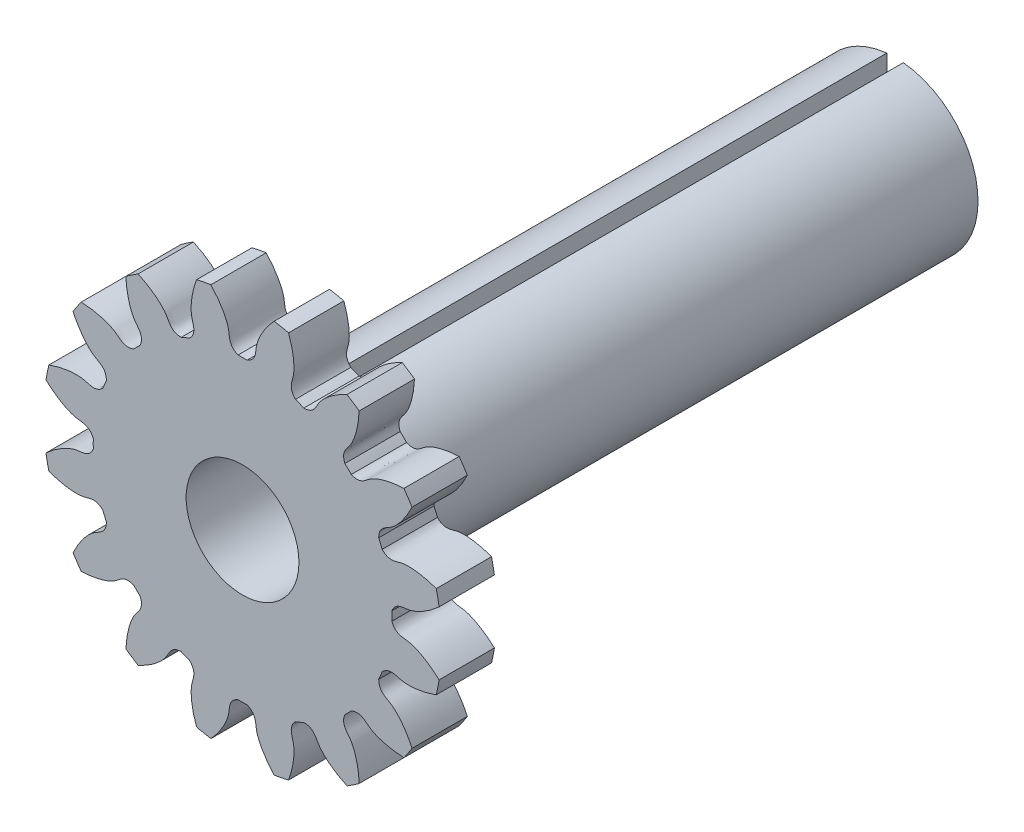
from build123d import *

# Parameters (mm, degrees)
SKETCH_1_R               = 18
EXTRUDE_1_DEPTH          = 30
CUT_EXTRUDE_1_DEPTH      = 40.344631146
PATTERN_CIRCULAR_1_COUNT = 16
SKETCH_4_R               = 23.482997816
CUT_EXTRUDE_2_DEPTH      = 20
SKETCH_5_R               = 9
EXTRUDE_2_DEPTH          = 2
SKETCH_6_R               = 7.5
EXTRUDE_3_DEPTH          = 54
SKETCH_7_R               = 5.1
CUT_EXTRUDE_3_DEPTH      = 63
CUT_EXTRUDE_START        = -4
SKETCH_8_R               = 7.5
CUT_EXTRUDE_4_DEPTH      = 4
CUT_EXTRUDE_START_2      = -50
CUT_EXTRUDE_5_DEPTH      = 50
EXTRUDE_4_DEPTH          = 2
SKETCH_11_R              = 22.388726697
CUT_EXTRUDE_6_DEPTH      = 5


with BuildPart() as part:
    # Sketch 1 → Extrude 1 (new body)
    with BuildSketch(Plane.XY):
        Circle(SKETCH_1_R)
    extrude(amount=EXTRUDE_1_DEPTH)

    # Sketch 2 → Cut-Extrude 1 (cut, through all)
    with BuildSketch(Plane.XY):
        with BuildLine():
            ThreePointArc((0.40672158, 13.493871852), (0, 13.5), (-0.40672158, 13.493871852))
            add(Edge.make_bspline(
                [(-0.40672158, 13.493871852), (-1.283678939, 13.860244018), (-1.138642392, 14.541399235), (-1.289562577, 15.17361985), (-1.302405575, 15.223101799), (-1.317864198, 15.278107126), (-1.336157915, 15.338549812), (-1.357511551, 15.404335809), (-1.382144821, 15.475364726), (-1.410275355, 15.551529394), (-1.442117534, 15.632716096), (-1.477882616, 15.718804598), (-1.517778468, 15.809668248), (-1.562009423, 15.905174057), (-1.610776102, 16.005182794), (-1.664275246, 16.109549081), (-1.722699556, 16.218121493), (-1.786237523, 16.330742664), (-1.855073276, 16.447249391), (-1.929386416, 16.567472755), (-2.009351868, 16.691238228), (-2.095139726, 16.8183658), (-2.186915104, 16.948670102), (-2.284837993, 17.081960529), (-2.389063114, 17.21804138), (-2.499739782, 17.356711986), (-2.617011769, 17.497766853), (-2.74101717, 17.640995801), (-2.871888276, 17.786184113), (-3.009751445, 17.933112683), (-3.154726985, 18.081558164), (-3.306929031, 18.23129313), (-3.466465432, 18.382086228), (-3.633437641, 18.533702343), (-3.807940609, 18.68590276), (-3.990062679, 18.838445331), (-4.179885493, 18.991084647), (-4.377483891, 19.143572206), (-4.582925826, 19.295656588), (-4.796272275, 19.447083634), (-5.017577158, 19.597596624), (-5.246887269, 19.746936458), (-5.484242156, 19.89484184), (-5.814929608, 20.091837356), (-6.069976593, 20.233482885), (-6.243559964, 20.3254849)],
                knots=[0, 0, 0, 0, 0.200958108, 0.205848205, 0.211390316, 0.217584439, 0.224430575, 0.231928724, 0.240078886, 0.248881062, 0.25833525, 0.268441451, 0.279199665, 0.290609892, 0.302672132, 0.315386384, 0.32875265, 0.342770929, 0.357441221, 0.372763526, 0.388737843, 0.405364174, 0.422642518, 0.440572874, 0.459155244, 0.478389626, 0.498276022, 0.51881443, 0.540004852, 0.561847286, 0.584341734, 0.607488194, 0.631286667, 0.655737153, 0.680839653, 0.706594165, 0.73300069, 0.760059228, 0.787769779, 0.816132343, 0.84514692, 0.87481351, 0.905132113, 0.936102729, 1, 1, 1, 1], degree=3))
            ThreePointArc((-6.243559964, 20.3254849), (0, 21.26281678), (6.243559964, 20.3254849))
            add(Edge.make_bspline(
                [(0.40672158, 13.493871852), (1.283678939, 13.860244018), (1.138642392, 14.541399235), (1.289562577, 15.17361985), (1.302405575, 15.223101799), (1.317864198, 15.278107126), (1.336157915, 15.338549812), (1.357511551, 15.404335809), (1.382144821, 15.475364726), (1.410275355, 15.551529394), (1.442117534, 15.632716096), (1.477882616, 15.718804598), (1.517778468, 15.809668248), (1.562009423, 15.905174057), (1.610776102, 16.005182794), (1.664275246, 16.109549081), (1.722699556, 16.218121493), (1.786237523, 16.330742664), (1.855073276, 16.447249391), (1.929386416, 16.567472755), (2.009351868, 16.691238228), (2.095139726, 16.8183658), (2.186915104, 16.948670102), (2.284837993, 17.081960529), (2.389063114, 17.21804138), (2.499739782, 17.356711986), (2.617011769, 17.497766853), (2.74101717, 17.640995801), (2.871888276, 17.786184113), (3.009751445, 17.933112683), (3.154726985, 18.081558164), (3.306929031, 18.23129313), (3.466465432, 18.382086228), (3.633437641, 18.533702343), (3.807940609, 18.68590276), (3.990062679, 18.838445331), (4.179885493, 18.991084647), (4.377483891, 19.143572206), (4.582925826, 19.295656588), (4.796272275, 19.447083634), (5.017577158, 19.597596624), (5.246887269, 19.746936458), (5.484242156, 19.89484184), (5.814929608, 20.091837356), (6.069976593, 20.233482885), (6.243559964, 20.3254849)],
                knots=[0, 0, 0, 0, 0.200958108, 0.205848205, 0.211390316, 0.217584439, 0.224430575, 0.231928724, 0.240078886, 0.248881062, 0.25833525, 0.268441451, 0.279199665, 0.290609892, 0.302672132, 0.315386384, 0.32875265, 0.342770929, 0.357441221, 0.372763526, 0.388737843, 0.405364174, 0.422642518, 0.440572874, 0.459155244, 0.478389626, 0.498276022, 0.51881443, 0.540004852, 0.561847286, 0.584341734, 0.607488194, 0.631286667, 0.655737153, 0.680839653, 0.706594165, 0.73300069, 0.760059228, 0.787769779, 0.816132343, 0.84514692, 0.87481351, 0.905132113, 0.936102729, 1, 1, 1, 1], degree=3))
        make_face()
    cut_extrude_1 = extrude(amount=CUT_EXTRUDE_1_DEPTH, mode=Mode.SUBTRACT)

    # Pattern Circular 1: Cut-Extrude 1 ×16 about axis
    pattern_circular_1_axis = Axis((0, 0, 30), (0, 0, -1))
    for i in range(1, PATTERN_CIRCULAR_1_COUNT):
        add(cut_extrude_1.rotate(pattern_circular_1_axis, i * 360 / PATTERN_CIRCULAR_1_COUNT), mode=Mode.SUBTRACT)

    # Sketch 4 → Cut-Extrude 2 (cut)
    with BuildSketch(Plane(origin=(0, 0, 0), x_dir=(-1, 0, 0), z_dir=(0, 0, -1))):
        Circle(SKETCH_4_R)
    extrude(amount=-CUT_EXTRUDE_2_DEPTH, mode=Mode.SUBTRACT)

    # Sketch 5 → Extrude 2 (add)
    with BuildSketch(Plane(origin=(0, 0, 20), x_dir=(-1, 0, 0), z_dir=(0, 0, -1))):
        Circle(SKETCH_5_R)
    extrude(amount=EXTRUDE_2_DEPTH)

    # Sketch 6 → Extrude 3 (add)
    with BuildSketch(Plane(origin=(0, 0, 18), x_dir=(-1, 0, 0), z_dir=(0, 0, -1))):
        Circle(SKETCH_6_R)
    extrude(amount=EXTRUDE_3_DEPTH)

    # Sketch 7 → Cut-Extrude 3 (cut)
    with BuildSketch(Plane.XY.offset(30)):
        Circle(SKETCH_7_R)
    extrude(amount=-CUT_EXTRUDE_3_DEPTH, mode=Mode.SUBTRACT)

    # Sketch 8 → Cut-Extrude 4 (cut)
    with BuildSketch(Plane(origin=(0, 0, -36), x_dir=(-1, 0, 0), z_dir=(0, 0, -1)).offset(CUT_EXTRUDE_START)):
        Circle(SKETCH_8_R)
    extrude(amount=CUT_EXTRUDE_4_DEPTH, mode=Mode.SUBTRACT)

    # Sketch 9 → Cut-Extrude 5 (cut)
    with BuildSketch(Plane(origin=(0, 0, -32), x_dir=(-1, 0, 0), z_dir=(0, 0, -1)).offset(CUT_EXTRUDE_START_2)):
        with BuildLine():
            Line((-0.75, 5.044551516), (-0.75, 17.277501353))
            Line((-0.75, 17.277501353), (0.75, 17.277501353))
            Line((0.75, 17.277501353), (0.75, 5.044551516))
            ThreePointArc((0.75, 5.044551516), (0, 5.1), (-0.75, 5.044551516))
        make_face()
    extrude(amount=CUT_EXTRUDE_5_DEPTH, mode=Mode.SUBTRACT)

    # Sketch 10 → Extrude 4 (add)
    with BuildSketch(Plane(origin=(0, 0, -32), x_dir=(-1, 0, 0), z_dir=(0, 0, -1))):
        with BuildLine():
            Line((0.75, 7.462405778), (0.75, 5.044551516))
            ThreePointArc((0.75, 5.044551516), (0, -5.1), (-0.75, 5.044551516))
            Line((-0.75, 5.044551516), (-0.75, 7.462405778))
            ThreePointArc((-0.75, 7.462405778), (0, -7.5), (0.75, 7.462405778))
        make_face()
    extrude(amount=EXTRUDE_4_DEPTH)

    # Sketch 11 → Cut-Extrude 6 (cut)
    with BuildSketch(Plane.XY.offset(30)):
        Circle(SKETCH_11_R)
    extrude(amount=-CUT_EXTRUDE_6_DEPTH, mode=Mode.SUBTRACT)


solid = part.part
